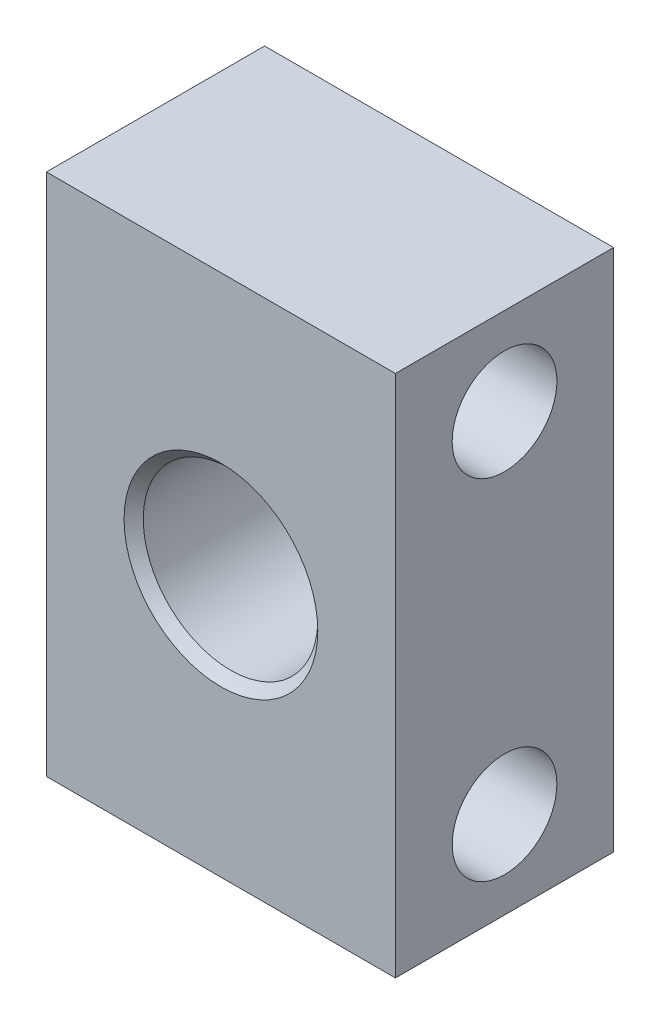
ISO-10303-21;
HEADER;
FILE_DESCRIPTION(('STEP AP214'),'2;1');
FILE_NAME('part.step','',(''),(''),'','','');
FILE_SCHEMA(('AUTOMOTIVE_DESIGN { 1 0 10303 214 1 1 1 1 }'));
ENDSEC;
DATA;
#1=APPLICATION_CONTEXT('core data for automotive mechanical design processes');
#2=APPLICATION_PROTOCOL_DEFINITION('international standard','automotive_design',2000,#1);
#3=PRODUCT_CONTEXT('',#1,'mechanical');
#4=PRODUCT('Part','Part','',(#3));
#5=PRODUCT_RELATED_PRODUCT_CATEGORY('part','',(#4));
#6=PRODUCT_DEFINITION_FORMATION('','',#4);
#7=PRODUCT_DEFINITION_CONTEXT('part definition',#1,'design');
#8=PRODUCT_DEFINITION('design','',#6,#7);
#9=PRODUCT_DEFINITION_SHAPE('','',#8);
#10=(LENGTH_UNIT() NAMED_UNIT(*) SI_UNIT(.MILLI.,.METRE.));
#11=(NAMED_UNIT(*) PLANE_ANGLE_UNIT() SI_UNIT($,.RADIAN.));
#12=(NAMED_UNIT(*) SI_UNIT($,.STERADIAN.) SOLID_ANGLE_UNIT());
#13=UNCERTAINTY_MEASURE_WITH_UNIT(LENGTH_MEASURE(1.E-05),#10,'distance_accuracy_value','');
#14=(GEOMETRIC_REPRESENTATION_CONTEXT(3) GLOBAL_UNCERTAINTY_ASSIGNED_CONTEXT((#13)) GLOBAL_UNIT_ASSIGNED_CONTEXT((#10,
#11,#12)) REPRESENTATION_CONTEXT('',''));
#15=CARTESIAN_POINT('',(0.,0.,0.));
#16=DIRECTION('',(0.,0.,1.));
#17=DIRECTION('',(1.,0.,0.));
#18=AXIS2_PLACEMENT_3D('',#15,#16,#17);
#19=CARTESIAN_POINT('',(-30.,30.,25.));
#20=DIRECTION('',(0.,-1.,0.));
#21=DIRECTION('',(0.,0.,1.));
#22=AXIS2_PLACEMENT_3D('',#19,#20,#21);
#23=PLANE('',#22);
#24=DIRECTION('',(0.,0.,-1.));
#25=VECTOR('',#24,1.);
#26=CARTESIAN_POINT('',(-20.,30.,25.));
#27=LINE('',#26,#25);
#28=CARTESIAN_POINT('',(-20.,30.,25.));
#29=VERTEX_POINT('',#28);
#30=CARTESIAN_POINT('',(-20.,30.,0.));
#31=VERTEX_POINT('',#30);
#32=EDGE_CURVE('E56',#29,#31,#27,.T.);
#33=ORIENTED_EDGE('',*,*,#32,.F.);
#34=DIRECTION('',(1.,0.,0.));
#35=VECTOR('',#34,1.);
#36=CARTESIAN_POINT('',(-30.,30.,25.));
#37=LINE('',#36,#35);
#38=CARTESIAN_POINT('',(20.,30.,25.));
#39=VERTEX_POINT('',#38);
#40=EDGE_CURVE('E37',#29,#39,#37,.T.);
#41=ORIENTED_EDGE('',*,*,#40,.T.);
#42=DIRECTION('',(0.,0.,-1.));
#43=VECTOR('',#42,1.);
#44=CARTESIAN_POINT('',(20.,30.,25.));
#45=LINE('',#44,#43);
#46=CARTESIAN_POINT('',(20.,30.,0.));
#47=VERTEX_POINT('',#46);
#48=EDGE_CURVE('E159',#39,#47,#45,.T.);
#49=ORIENTED_EDGE('',*,*,#48,.T.);
#50=DIRECTION('',(1.,0.,0.));
#51=VECTOR('',#50,1.);
#52=CARTESIAN_POINT('',(-30.,30.,0.));
#53=LINE('',#52,#51);
#54=EDGE_CURVE('E63',#31,#47,#53,.T.);
#55=ORIENTED_EDGE('',*,*,#54,.F.);
#56=EDGE_LOOP('',(#33,#41,#49,#55));
#57=FACE_BOUND('',#56,.T.);
#58=ADVANCED_FACE('F14',(#57),#23,.F.);
#59=CARTESIAN_POINT('',(-30.,-30.,0.));
#60=DIRECTION('',(0.,0.,-1.));
#61=DIRECTION('',(0.,-1.,0.));
#62=AXIS2_PLACEMENT_3D('',#59,#60,#61);
#63=PLANE('',#62);
#64=CARTESIAN_POINT('',(0.,0.,0.));
#65=DIRECTION('',(0.,0.,-1.));
#66=DIRECTION('',(0.,-1.,0.));
#67=AXIS2_PLACEMENT_3D('',#64,#65,#66);
#68=CIRCLE('',#67,11.1);
#69=CARTESIAN_POINT('',(0.,-11.1,0.));
#70=VERTEX_POINT('',#69);
#71=EDGE_CURVE('E22',#70,#70,#68,.F.);
#72=ORIENTED_EDGE('',*,*,#71,.T.);
#73=EDGE_LOOP('',(#72));
#74=FACE_BOUND('',#73,.T.);
#75=DIRECTION('',(1.,0.,0.));
#76=VECTOR('',#75,1.);
#77=CARTESIAN_POINT('',(-30.,-30.,0.));
#78=LINE('',#77,#76);
#79=CARTESIAN_POINT('',(-20.,-30.,0.));
#80=VERTEX_POINT('',#79);
#81=CARTESIAN_POINT('',(20.,-30.,0.));
#82=VERTEX_POINT('',#81);
#83=EDGE_CURVE('E72',#80,#82,#78,.T.);
#84=ORIENTED_EDGE('',*,*,#83,.F.);
#85=DIRECTION('',(0.,-1.,0.));
#86=VECTOR('',#85,1.);
#87=CARTESIAN_POINT('',(-20.,30.,0.));
#88=LINE('',#87,#86);
#89=EDGE_CURVE('E64',#31,#80,#88,.T.);
#90=ORIENTED_EDGE('',*,*,#89,.F.);
#91=ORIENTED_EDGE('',*,*,#54,.T.);
#92=DIRECTION('',(0.,1.,0.));
#93=VECTOR('',#92,1.);
#94=CARTESIAN_POINT('',(20.,-30.,0.));
#95=LINE('',#94,#93);
#96=EDGE_CURVE('E161',#82,#47,#95,.T.);
#97=ORIENTED_EDGE('',*,*,#96,.F.);
#98=EDGE_LOOP('',(#84,#90,#91,#97));
#99=FACE_BOUND('',#98,.T.);
#100=ADVANCED_FACE('F88',(#74,#99),#63,.T.);
#101=CARTESIAN_POINT('',(-30.,-30.,0.));
#102=DIRECTION('',(0.,1.,0.));
#103=DIRECTION('',(0.,0.,-1.));
#104=AXIS2_PLACEMENT_3D('',#101,#102,#103);
#105=PLANE('',#104);
#106=DIRECTION('',(0.,0.,1.));
#107=VECTOR('',#106,1.);
#108=CARTESIAN_POINT('',(-20.,-30.,0.));
#109=LINE('',#108,#107);
#110=CARTESIAN_POINT('',(-20.,-30.,25.));
#111=VERTEX_POINT('',#110);
#112=EDGE_CURVE('E29',#80,#111,#109,.T.);
#113=ORIENTED_EDGE('',*,*,#112,.F.);
#114=ORIENTED_EDGE('',*,*,#83,.T.);
#115=DIRECTION('',(0.,0.,1.));
#116=VECTOR('',#115,1.);
#117=CARTESIAN_POINT('',(20.,-30.,0.));
#118=LINE('',#117,#116);
#119=CARTESIAN_POINT('',(20.,-30.,25.));
#120=VERTEX_POINT('',#119);
#121=EDGE_CURVE('E74',#82,#120,#118,.T.);
#122=ORIENTED_EDGE('',*,*,#121,.T.);
#123=DIRECTION('',(1.,0.,0.));
#124=VECTOR('',#123,1.);
#125=CARTESIAN_POINT('',(-30.,-30.,25.));
#126=LINE('',#125,#124);
#127=EDGE_CURVE('E70',#111,#120,#126,.T.);
#128=ORIENTED_EDGE('',*,*,#127,.F.);
#129=EDGE_LOOP('',(#113,#114,#122,#128));
#130=FACE_BOUND('',#129,.T.);
#131=ADVANCED_FACE('F109',(#130),#105,.F.);
#132=CARTESIAN_POINT('',(-30.,30.,25.));
#133=DIRECTION('',(0.,0.,1.));
#134=DIRECTION('',(0.,1.,0.));
#135=AXIS2_PLACEMENT_3D('',#132,#133,#134);
#136=PLANE('',#135);
#137=CARTESIAN_POINT('',(0.,0.,25.));
#138=DIRECTION('',(0.,0.,1.));
#139=DIRECTION('',(0.,1.,0.));
#140=AXIS2_PLACEMENT_3D('',#137,#138,#139);
#141=CIRCLE('',#140,11.1);
#142=CARTESIAN_POINT('',(0.,11.1,25.));
#143=VERTEX_POINT('',#142);
#144=EDGE_CURVE('E9',#143,#143,#141,.F.);
#145=ORIENTED_EDGE('',*,*,#144,.T.);
#146=EDGE_LOOP('',(#145));
#147=FACE_BOUND('',#146,.T.);
#148=ORIENTED_EDGE('',*,*,#40,.F.);
#149=DIRECTION('',(0.,1.,0.));
#150=VECTOR('',#149,1.);
#151=CARTESIAN_POINT('',(-20.,-30.,25.));
#152=LINE('',#151,#150);
#153=EDGE_CURVE('E54',#111,#29,#152,.T.);
#154=ORIENTED_EDGE('',*,*,#153,.F.);
#155=ORIENTED_EDGE('',*,*,#127,.T.);
#156=DIRECTION('',(0.,-1.,0.));
#157=VECTOR('',#156,1.);
#158=CARTESIAN_POINT('',(20.,30.,25.));
#159=LINE('',#158,#157);
#160=EDGE_CURVE('E69',#39,#120,#159,.T.);
#161=ORIENTED_EDGE('',*,*,#160,.F.);
#162=EDGE_LOOP('',(#148,#154,#155,#161));
#163=FACE_BOUND('',#162,.T.);
#164=ADVANCED_FACE('F67',(#147,#163),#136,.T.);
#165=CARTESIAN_POINT('',(-30.,-20.,12.5));
#166=DIRECTION('',(1.,0.,0.));
#167=DIRECTION('',(0.,0.,1.));
#168=AXIS2_PLACEMENT_3D('',#165,#166,#167);
#169=CYLINDRICAL_SURFACE('',#168,6.);
#170=CARTESIAN_POINT('',(20.,-20.,12.5));
#171=DIRECTION('',(-1.,0.,0.));
#172=DIRECTION('',(0.,0.,-1.));
#173=AXIS2_PLACEMENT_3D('',#170,#171,#172);
#174=CIRCLE('',#173,6.);
#175=CARTESIAN_POINT('',(20.,-20.,6.5));
#176=VERTEX_POINT('',#175);
#177=EDGE_CURVE('E156',#176,#176,#174,.T.);
#178=ORIENTED_EDGE('',*,*,#177,.F.);
#179=EDGE_LOOP('',(#178));
#180=FACE_BOUND('',#179,.T.);
#181=CARTESIAN_POINT('',(-20.,-20.,12.5));
#182=DIRECTION('',(-1.,0.,0.));
#183=DIRECTION('',(0.,0.,-1.));
#184=AXIS2_PLACEMENT_3D('',#181,#182,#183);
#185=CIRCLE('',#184,6.);
#186=CARTESIAN_POINT('',(-20.,-20.,6.5));
#187=VERTEX_POINT('',#186);
#188=EDGE_CURVE('E60',#187,#187,#185,.T.);
#189=ORIENTED_EDGE('',*,*,#188,.T.);
#190=EDGE_LOOP('',(#189));
#191=FACE_BOUND('',#190,.T.);
#192=ADVANCED_FACE('F108',(#180,#191),#169,.F.);
#193=CARTESIAN_POINT('',(-30.,20.,12.5));
#194=DIRECTION('',(1.,0.,0.));
#195=DIRECTION('',(0.,0.,1.));
#196=AXIS2_PLACEMENT_3D('',#193,#194,#195);
#197=CYLINDRICAL_SURFACE('',#196,6.);
#198=CARTESIAN_POINT('',(20.,20.,12.5));
#199=DIRECTION('',(1.,0.,0.));
#200=DIRECTION('',(0.,0.,1.));
#201=AXIS2_PLACEMENT_3D('',#198,#199,#200);
#202=CIRCLE('',#201,6.);
#203=CARTESIAN_POINT('',(20.,20.,18.5));
#204=VERTEX_POINT('',#203);
#205=EDGE_CURVE('E153',#204,#204,#202,.T.);
#206=ORIENTED_EDGE('',*,*,#205,.T.);
#207=EDGE_LOOP('',(#206));
#208=FACE_BOUND('',#207,.T.);
#209=CARTESIAN_POINT('',(-20.,20.,12.5));
#210=DIRECTION('',(-1.,0.,0.));
#211=DIRECTION('',(0.,0.,-1.));
#212=AXIS2_PLACEMENT_3D('',#209,#210,#211);
#213=CIRCLE('',#212,6.);
#214=CARTESIAN_POINT('',(-20.,20.,6.5));
#215=VERTEX_POINT('',#214);
#216=EDGE_CURVE('E144',#215,#215,#213,.T.);
#217=ORIENTED_EDGE('',*,*,#216,.T.);
#218=EDGE_LOOP('',(#217));
#219=FACE_BOUND('',#218,.T.);
#220=ADVANCED_FACE('F117',(#208,#219),#197,.F.);
#221=CARTESIAN_POINT('',(20.,30.,25.));
#222=DIRECTION('',(-1.,0.,0.));
#223=DIRECTION('',(0.,0.,-1.));
#224=AXIS2_PLACEMENT_3D('',#221,#222,#223);
#225=PLANE('',#224);
#226=ORIENTED_EDGE('',*,*,#205,.F.);
#227=EDGE_LOOP('',(#226));
#228=FACE_BOUND('',#227,.T.);
#229=ORIENTED_EDGE('',*,*,#48,.F.);
#230=ORIENTED_EDGE('',*,*,#160,.T.);
#231=ORIENTED_EDGE('',*,*,#121,.F.);
#232=ORIENTED_EDGE('',*,*,#96,.T.);
#233=EDGE_LOOP('',(#229,#230,#231,#232));
#234=FACE_BOUND('',#233,.T.);
#235=ORIENTED_EDGE('',*,*,#177,.T.);
#236=EDGE_LOOP('',(#235));
#237=FACE_BOUND('',#236,.T.);
#238=ADVANCED_FACE('F99',(#228,#234,#237),#225,.F.);
#239=CARTESIAN_POINT('',(0.,0.,25.));
#240=DIRECTION('',(0.,0.,-1.));
#241=DIRECTION('',(0.,-1.,0.));
#242=AXIS2_PLACEMENT_3D('',#239,#240,#241);
#243=CYLINDRICAL_SURFACE('',#242,10.);
#244=CARTESIAN_POINT('',(0.,0.,1.1));
#245=DIRECTION('',(0.,0.,-1.));
#246=DIRECTION('',(0.,-1.,0.));
#247=AXIS2_PLACEMENT_3D('',#244,#245,#246);
#248=CIRCLE('',#247,10.);
#249=CARTESIAN_POINT('',(0.,-10.,1.1));
#250=VERTEX_POINT('',#249);
#251=EDGE_CURVE('E83',#250,#250,#248,.T.);
#252=ORIENTED_EDGE('',*,*,#251,.T.);
#253=EDGE_LOOP('',(#252));
#254=FACE_BOUND('',#253,.T.);
#255=CARTESIAN_POINT('',(0.,0.,23.9));
#256=DIRECTION('',(0.,0.,1.));
#257=DIRECTION('',(0.,1.,0.));
#258=AXIS2_PLACEMENT_3D('',#255,#256,#257);
#259=CIRCLE('',#258,10.);
#260=CARTESIAN_POINT('',(0.,10.,23.9));
#261=VERTEX_POINT('',#260);
#262=EDGE_CURVE('E80',#261,#261,#259,.T.);
#263=ORIENTED_EDGE('',*,*,#262,.T.);
#264=EDGE_LOOP('',(#263));
#265=FACE_BOUND('',#264,.T.);
#266=ADVANCED_FACE('F96',(#254,#265),#243,.F.);
#267=CARTESIAN_POINT('',(-20.,30.,25.));
#268=DIRECTION('',(-1.,0.,0.));
#269=DIRECTION('',(0.,0.,-1.));
#270=AXIS2_PLACEMENT_3D('',#267,#268,#269);
#271=PLANE('',#270);
#272=ORIENTED_EDGE('',*,*,#216,.F.);
#273=EDGE_LOOP('',(#272));
#274=FACE_BOUND('',#273,.T.);
#275=ORIENTED_EDGE('',*,*,#188,.F.);
#276=EDGE_LOOP('',(#275));
#277=FACE_BOUND('',#276,.T.);
#278=ORIENTED_EDGE('',*,*,#153,.T.);
#279=ORIENTED_EDGE('',*,*,#32,.T.);
#280=ORIENTED_EDGE('',*,*,#89,.T.);
#281=ORIENTED_EDGE('',*,*,#112,.T.);
#282=EDGE_LOOP('',(#278,#279,#280,#281));
#283=FACE_BOUND('',#282,.T.);
#284=ADVANCED_FACE('F55',(#274,#277,#283),#271,.T.);
#285=CARTESIAN_POINT('',(0.,0.,1.1));
#286=DIRECTION('',(0.,0.,-1.));
#287=DIRECTION('',(0.,-1.,0.));
#288=AXIS2_PLACEMENT_3D('',#285,#286,#287);
#289=CONICAL_SURFACE('',#288,10.,0.785398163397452);
#290=ORIENTED_EDGE('',*,*,#71,.F.);
#291=EDGE_LOOP('',(#290));
#292=FACE_BOUND('',#291,.T.);
#293=ORIENTED_EDGE('',*,*,#251,.F.);
#294=EDGE_LOOP('',(#293));
#295=FACE_BOUND('',#294,.T.);
#296=ADVANCED_FACE('F91',(#292,#295),#289,.F.);
#297=CARTESIAN_POINT('',(0.,0.,25.));
#298=DIRECTION('',(0.,0.,1.));
#299=DIRECTION('',(0.,1.,0.));
#300=AXIS2_PLACEMENT_3D('',#297,#298,#299);
#301=CONICAL_SURFACE('',#300,11.1,0.785398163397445);
#302=ORIENTED_EDGE('',*,*,#262,.F.);
#303=EDGE_LOOP('',(#302));
#304=FACE_BOUND('',#303,.T.);
#305=ORIENTED_EDGE('',*,*,#144,.F.);
#306=EDGE_LOOP('',(#305));
#307=FACE_BOUND('',#306,.T.);
#308=ADVANCED_FACE('F16',(#304,#307),#301,.F.);
#309=CLOSED_SHELL('',(#58,#100,#131,#164,#192,#220,#238,#266,#284,#296,#308));
#310=MANIFOLD_SOLID_BREP('B1',#309);
#311=ADVANCED_BREP_SHAPE_REPRESENTATION('',(#18,#310),#14);
#312=SHAPE_DEFINITION_REPRESENTATION(#9,#311);
ENDSEC;
END-ISO-10303-21;
